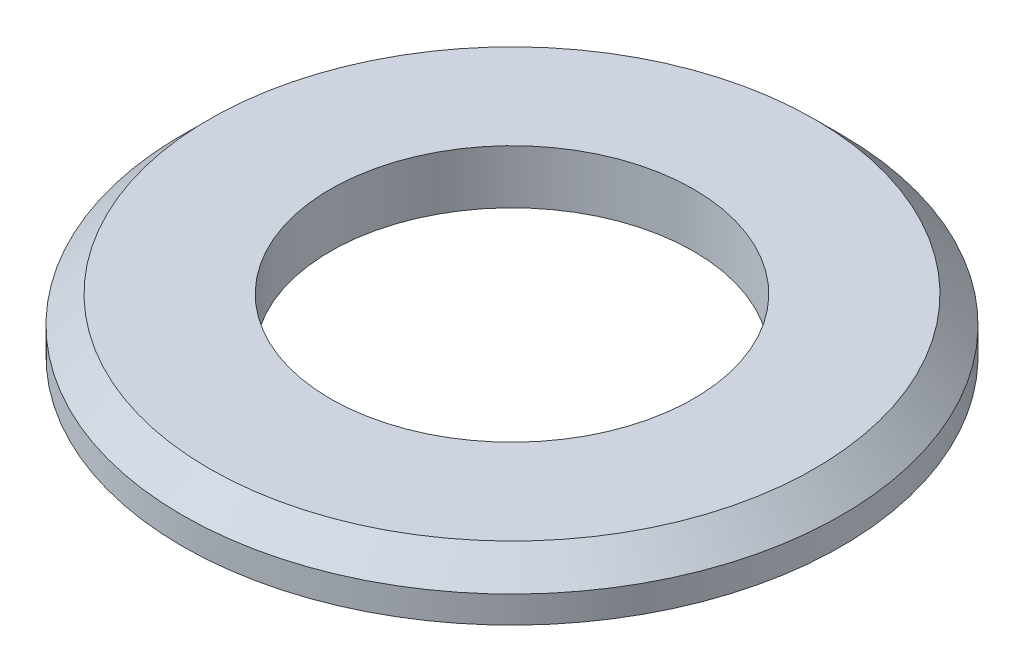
ISO-10303-21;
HEADER;
FILE_DESCRIPTION(('STEP AP214'),'2;1');
FILE_NAME('part.step','',(''),(''),'','','');
FILE_SCHEMA(('AUTOMOTIVE_DESIGN { 1 0 10303 214 1 1 1 1 }'));
ENDSEC;
DATA;
#1=APPLICATION_CONTEXT('core data for automotive mechanical design processes');
#2=APPLICATION_PROTOCOL_DEFINITION('international standard','automotive_design',2000,#1);
#3=PRODUCT_CONTEXT('',#1,'mechanical');
#4=PRODUCT('Part','Part','',(#3));
#5=PRODUCT_RELATED_PRODUCT_CATEGORY('part','',(#4));
#6=PRODUCT_DEFINITION_FORMATION('','',#4);
#7=PRODUCT_DEFINITION_CONTEXT('part definition',#1,'design');
#8=PRODUCT_DEFINITION('design','',#6,#7);
#9=PRODUCT_DEFINITION_SHAPE('','',#8);
#10=(LENGTH_UNIT() NAMED_UNIT(*) SI_UNIT(.MILLI.,.METRE.));
#11=(NAMED_UNIT(*) PLANE_ANGLE_UNIT() SI_UNIT($,.RADIAN.));
#12=(NAMED_UNIT(*) SI_UNIT($,.STERADIAN.) SOLID_ANGLE_UNIT());
#13=UNCERTAINTY_MEASURE_WITH_UNIT(LENGTH_MEASURE(1.E-05),#10,'distance_accuracy_value','');
#14=(GEOMETRIC_REPRESENTATION_CONTEXT(3) GLOBAL_UNCERTAINTY_ASSIGNED_CONTEXT((#13)) GLOBAL_UNIT_ASSIGNED_CONTEXT((#10,
#11,#12)) REPRESENTATION_CONTEXT('',''));
#15=CARTESIAN_POINT('',(0.,0.,0.));
#16=DIRECTION('',(0.,0.,1.));
#17=DIRECTION('',(1.,0.,0.));
#18=AXIS2_PLACEMENT_3D('',#15,#16,#17);
#19=CARTESIAN_POINT('',(0.,8.,0.));
#20=DIRECTION('',(0.,1.,0.));
#21=DIRECTION('',(0.,0.,1.));
#22=AXIS2_PLACEMENT_3D('',#19,#20,#21);
#23=PLANE('',#22);
#24=CARTESIAN_POINT('',(0.,8.,0.));
#25=DIRECTION('',(0.,1.,0.));
#26=DIRECTION('',(0.,0.,1.));
#27=AXIS2_PLACEMENT_3D('',#24,#25,#26);
#28=CIRCLE('',#27,45.);
#29=CARTESIAN_POINT('',(0.,8.,45.));
#30=VERTEX_POINT('',#29);
#31=EDGE_CURVE('E35',#30,#30,#28,.T.);
#32=ORIENTED_EDGE('',*,*,#31,.T.);
#33=EDGE_LOOP('',(#32));
#34=FACE_BOUND('',#33,.T.);
#35=CARTESIAN_POINT('',(0.,8.,0.));
#36=DIRECTION('',(0.,1.,0.));
#37=DIRECTION('',(0.,0.,1.));
#38=AXIS2_PLACEMENT_3D('',#35,#36,#37);
#39=CIRCLE('',#38,27.);
#40=CARTESIAN_POINT('',(0.,8.,27.));
#41=VERTEX_POINT('',#40);
#42=EDGE_CURVE('E43',#41,#41,#39,.T.);
#43=ORIENTED_EDGE('',*,*,#42,.F.);
#44=EDGE_LOOP('',(#43));
#45=FACE_BOUND('',#44,.T.);
#46=ADVANCED_FACE('F28',(#34,#45),#23,.T.);
#47=CARTESIAN_POINT('',(0.,0.,0.));
#48=DIRECTION('',(0.,1.,0.));
#49=DIRECTION('',(0.,0.,1.));
#50=AXIS2_PLACEMENT_3D('',#47,#48,#49);
#51=PLANE('',#50);
#52=CARTESIAN_POINT('',(0.,0.,0.));
#53=DIRECTION('',(0.,1.,0.));
#54=DIRECTION('',(0.,0.,1.));
#55=AXIS2_PLACEMENT_3D('',#52,#53,#54);
#56=CIRCLE('',#55,49.);
#57=CARTESIAN_POINT('',(0.,0.,49.));
#58=VERTEX_POINT('',#57);
#59=EDGE_CURVE('E39',#58,#58,#56,.T.);
#60=ORIENTED_EDGE('',*,*,#59,.F.);
#61=EDGE_LOOP('',(#60));
#62=FACE_BOUND('',#61,.T.);
#63=CARTESIAN_POINT('',(0.,0.,0.));
#64=DIRECTION('',(0.,1.,0.));
#65=DIRECTION('',(0.,0.,1.));
#66=AXIS2_PLACEMENT_3D('',#63,#64,#65);
#67=CIRCLE('',#66,27.);
#68=CARTESIAN_POINT('',(0.,0.,27.));
#69=VERTEX_POINT('',#68);
#70=EDGE_CURVE('E48',#69,#69,#67,.T.);
#71=ORIENTED_EDGE('',*,*,#70,.T.);
#72=EDGE_LOOP('',(#71));
#73=FACE_BOUND('',#72,.T.);
#74=ADVANCED_FACE('F52',(#62,#73),#51,.F.);
#75=CARTESIAN_POINT('',(0.,8.,0.));
#76=DIRECTION('',(0.,-1.,0.));
#77=DIRECTION('',(0.,0.,-1.));
#78=AXIS2_PLACEMENT_3D('',#75,#76,#77);
#79=CYLINDRICAL_SURFACE('',#78,49.);
#80=CARTESIAN_POINT('',(0.,4.,0.));
#81=DIRECTION('',(0.,1.,0.));
#82=DIRECTION('',(0.,0.,1.));
#83=AXIS2_PLACEMENT_3D('',#80,#81,#82);
#84=CIRCLE('',#83,49.);
#85=CARTESIAN_POINT('',(0.,4.,49.));
#86=VERTEX_POINT('',#85);
#87=EDGE_CURVE('E10',#86,#86,#84,.F.);
#88=ORIENTED_EDGE('',*,*,#87,.T.);
#89=EDGE_LOOP('',(#88));
#90=FACE_BOUND('',#89,.T.);
#91=ORIENTED_EDGE('',*,*,#59,.T.);
#92=EDGE_LOOP('',(#91));
#93=FACE_BOUND('',#92,.T.);
#94=ADVANCED_FACE('F30',(#90,#93),#79,.T.);
#95=CARTESIAN_POINT('',(0.,8.,0.));
#96=DIRECTION('',(0.,-1.,0.));
#97=DIRECTION('',(0.,0.,-1.));
#98=AXIS2_PLACEMENT_3D('',#95,#96,#97);
#99=CYLINDRICAL_SURFACE('',#98,27.);
#100=ORIENTED_EDGE('',*,*,#42,.T.);
#101=EDGE_LOOP('',(#100));
#102=FACE_BOUND('',#101,.T.);
#103=ORIENTED_EDGE('',*,*,#70,.F.);
#104=EDGE_LOOP('',(#103));
#105=FACE_BOUND('',#104,.T.);
#106=ADVANCED_FACE('F54',(#102,#105),#99,.F.);
#107=CARTESIAN_POINT('',(0.,8.,0.));
#108=DIRECTION('',(0.,-1.,0.));
#109=DIRECTION('',(0.,0.,-1.));
#110=AXIS2_PLACEMENT_3D('',#107,#108,#109);
#111=CONICAL_SURFACE('',#110,45.,0.785398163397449);
#112=ORIENTED_EDGE('',*,*,#87,.F.);
#113=EDGE_LOOP('',(#112));
#114=FACE_BOUND('',#113,.T.);
#115=ORIENTED_EDGE('',*,*,#31,.F.);
#116=EDGE_LOOP('',(#115));
#117=FACE_BOUND('',#116,.T.);
#118=ADVANCED_FACE('F56',(#114,#117),#111,.T.);
#119=CLOSED_SHELL('',(#46,#74,#94,#106,#118));
#120=MANIFOLD_SOLID_BREP('B2',#119);
#121=ADVANCED_BREP_SHAPE_REPRESENTATION('',(#18,#120),#14);
#122=SHAPE_DEFINITION_REPRESENTATION(#9,#121);
ENDSEC;
END-ISO-10303-21;
